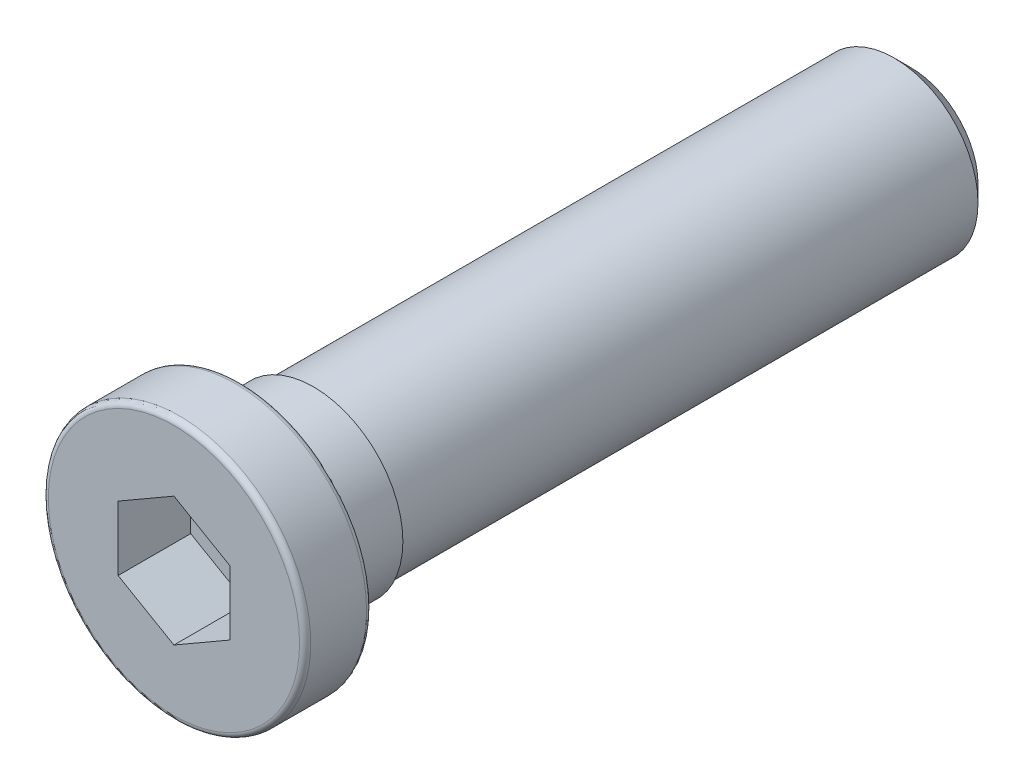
ISO-10303-21;
HEADER;
FILE_DESCRIPTION(('STEP AP214'),'2;1');
FILE_NAME('part.step','',(''),(''),'','','');
FILE_SCHEMA(('AUTOMOTIVE_DESIGN { 1 0 10303 214 1 1 1 1 }'));
ENDSEC;
DATA;
#1=APPLICATION_CONTEXT('core data for automotive mechanical design processes');
#2=APPLICATION_PROTOCOL_DEFINITION('international standard','automotive_design',2000,#1);
#3=PRODUCT_CONTEXT('',#1,'mechanical');
#4=PRODUCT('Part','Part','',(#3));
#5=PRODUCT_RELATED_PRODUCT_CATEGORY('part','',(#4));
#6=PRODUCT_DEFINITION_FORMATION('','',#4);
#7=PRODUCT_DEFINITION_CONTEXT('part definition',#1,'design');
#8=PRODUCT_DEFINITION('design','',#6,#7);
#9=PRODUCT_DEFINITION_SHAPE('','',#8);
#10=(LENGTH_UNIT() NAMED_UNIT(*) SI_UNIT(.MILLI.,.METRE.));
#11=(NAMED_UNIT(*) PLANE_ANGLE_UNIT() SI_UNIT($,.RADIAN.));
#12=(NAMED_UNIT(*) SI_UNIT($,.STERADIAN.) SOLID_ANGLE_UNIT());
#13=UNCERTAINTY_MEASURE_WITH_UNIT(LENGTH_MEASURE(1.E-05),#10,'distance_accuracy_value','');
#14=(GEOMETRIC_REPRESENTATION_CONTEXT(3) GLOBAL_UNCERTAINTY_ASSIGNED_CONTEXT((#13)) GLOBAL_UNIT_ASSIGNED_CONTEXT((#10,
#11,#12)) REPRESENTATION_CONTEXT('',''));
#15=CARTESIAN_POINT('',(0.,0.,0.));
#16=DIRECTION('',(0.,0.,1.));
#17=DIRECTION('',(1.,0.,0.));
#18=AXIS2_PLACEMENT_3D('',#15,#16,#17);
#19=CARTESIAN_POINT('',(0.,0.,11.9));
#20=DIRECTION('',(0.,0.,1.));
#21=DIRECTION('',(1.,0.,0.));
#22=AXIS2_PLACEMENT_3D('',#19,#20,#21);
#23=PLANE('',#22);
#24=DIRECTION('',(0.866025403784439,0.5,0.));
#25=VECTOR('',#24,1.);
#26=CARTESIAN_POINT('',(0.,-1.15470053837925,11.9));
#27=LINE('',#26,#25);
#28=CARTESIAN_POINT('',(0.,-1.15470053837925,11.9));
#29=VERTEX_POINT('',#28);
#30=CARTESIAN_POINT('',(1.,-0.577350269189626,11.9));
#31=VERTEX_POINT('',#30);
#32=EDGE_CURVE('E81',#29,#31,#27,.T.);
#33=ORIENTED_EDGE('',*,*,#32,.T.);
#34=DIRECTION('',(0.,1.,0.));
#35=VECTOR('',#34,1.);
#36=CARTESIAN_POINT('',(1.,-0.577350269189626,11.9));
#37=LINE('',#36,#35);
#38=CARTESIAN_POINT('',(1.,0.577350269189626,11.9));
#39=VERTEX_POINT('',#38);
#40=EDGE_CURVE('E83',#31,#39,#37,.T.);
#41=ORIENTED_EDGE('',*,*,#40,.T.);
#42=DIRECTION('',(-0.866025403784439,0.5,0.));
#43=VECTOR('',#42,1.);
#44=CARTESIAN_POINT('',(1.,0.577350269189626,11.9));
#45=LINE('',#44,#43);
#46=CARTESIAN_POINT('',(0.,1.15470053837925,11.9));
#47=VERTEX_POINT('',#46);
#48=EDGE_CURVE('E85',#39,#47,#45,.T.);
#49=ORIENTED_EDGE('',*,*,#48,.T.);
#50=DIRECTION('',(-0.866025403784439,-0.5,0.));
#51=VECTOR('',#50,1.);
#52=CARTESIAN_POINT('',(0.,1.15470053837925,11.9));
#53=LINE('',#52,#51);
#54=CARTESIAN_POINT('',(-1.,0.577350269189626,11.9));
#55=VERTEX_POINT('',#54);
#56=EDGE_CURVE('E188',#47,#55,#53,.T.);
#57=ORIENTED_EDGE('',*,*,#56,.T.);
#58=DIRECTION('',(0.,-1.,0.));
#59=VECTOR('',#58,1.);
#60=CARTESIAN_POINT('',(-1.,0.577350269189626,11.9));
#61=LINE('',#60,#59);
#62=CARTESIAN_POINT('',(-1.,-0.577350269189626,11.9));
#63=VERTEX_POINT('',#62);
#64=EDGE_CURVE('E193',#55,#63,#61,.T.);
#65=ORIENTED_EDGE('',*,*,#64,.T.);
#66=DIRECTION('',(0.866025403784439,-0.5,0.));
#67=VECTOR('',#66,1.);
#68=CARTESIAN_POINT('',(-1.,-0.577350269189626,11.9));
#69=LINE('',#68,#67);
#70=EDGE_CURVE('E197',#63,#29,#69,.T.);
#71=ORIENTED_EDGE('',*,*,#70,.T.);
#72=EDGE_LOOP('',(#33,#41,#49,#57,#65,#71));
#73=FACE_BOUND('',#72,.T.);
#74=ADVANCED_FACE('F17',(#73),#23,.T.);
#75=CARTESIAN_POINT('',(1.,0.577350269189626,11.9));
#76=DIRECTION('',(0.5,0.866025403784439,0.));
#77=DIRECTION('',(-0.866025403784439,0.5,0.));
#78=AXIS2_PLACEMENT_3D('',#75,#76,#77);
#79=PLANE('',#78);
#80=DIRECTION('',(0.,0.,1.));
#81=VECTOR('',#80,1.);
#82=CARTESIAN_POINT('',(0.,1.15470053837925,11.9));
#83=LINE('',#82,#81);
#84=CARTESIAN_POINT('',(0.,1.15470053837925,13.2));
#85=VERTEX_POINT('',#84);
#86=EDGE_CURVE('E96',#85,#47,#83,.F.);
#87=ORIENTED_EDGE('',*,*,#86,.T.);
#88=ORIENTED_EDGE('',*,*,#48,.F.);
#89=DIRECTION('',(0.,0.,1.));
#90=VECTOR('',#89,1.);
#91=CARTESIAN_POINT('',(1.,0.577350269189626,11.9));
#92=LINE('',#91,#90);
#93=CARTESIAN_POINT('',(1.,0.577350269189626,13.2));
#94=VERTEX_POINT('',#93);
#95=EDGE_CURVE('E90',#39,#94,#92,.T.);
#96=ORIENTED_EDGE('',*,*,#95,.T.);
#97=DIRECTION('',(0.866025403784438,-0.5,0.));
#98=VECTOR('',#97,1.);
#99=CARTESIAN_POINT('',(0.,1.15470053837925,13.2));
#100=LINE('',#99,#98);
#101=EDGE_CURVE('E187',#85,#94,#100,.T.);
#102=ORIENTED_EDGE('',*,*,#101,.F.);
#103=EDGE_LOOP('',(#87,#88,#96,#102));
#104=FACE_BOUND('',#103,.T.);
#105=ADVANCED_FACE('F93',(#104),#79,.F.);
#106=CARTESIAN_POINT('',(1.,-0.577350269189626,11.9));
#107=DIRECTION('',(1.,0.,0.));
#108=DIRECTION('',(0.,1.,0.));
#109=AXIS2_PLACEMENT_3D('',#106,#107,#108);
#110=PLANE('',#109);
#111=ORIENTED_EDGE('',*,*,#95,.F.);
#112=ORIENTED_EDGE('',*,*,#40,.F.);
#113=DIRECTION('',(0.,0.,1.));
#114=VECTOR('',#113,1.);
#115=CARTESIAN_POINT('',(1.,-0.577350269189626,11.9));
#116=LINE('',#115,#114);
#117=CARTESIAN_POINT('',(1.,-0.577350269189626,13.2));
#118=VERTEX_POINT('',#117);
#119=EDGE_CURVE('E104',#31,#118,#116,.T.);
#120=ORIENTED_EDGE('',*,*,#119,.T.);
#121=DIRECTION('',(0.,1.,0.));
#122=VECTOR('',#121,1.);
#123=CARTESIAN_POINT('',(1.,0.,13.2));
#124=LINE('',#123,#122);
#125=EDGE_CURVE('E101',#94,#118,#124,.F.);
#126=ORIENTED_EDGE('',*,*,#125,.F.);
#127=EDGE_LOOP('',(#111,#112,#120,#126));
#128=FACE_BOUND('',#127,.T.);
#129=ADVANCED_FACE('F99',(#128),#110,.F.);
#130=CARTESIAN_POINT('',(0.,-1.15470053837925,11.9));
#131=DIRECTION('',(0.5,-0.866025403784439,0.));
#132=DIRECTION('',(0.866025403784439,0.5,0.));
#133=AXIS2_PLACEMENT_3D('',#130,#131,#132);
#134=PLANE('',#133);
#135=ORIENTED_EDGE('',*,*,#119,.F.);
#136=ORIENTED_EDGE('',*,*,#32,.F.);
#137=DIRECTION('',(0.,0.,1.));
#138=VECTOR('',#137,1.);
#139=CARTESIAN_POINT('',(0.,-1.15470053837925,11.9));
#140=LINE('',#139,#138);
#141=CARTESIAN_POINT('',(0.,-1.15470053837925,13.2));
#142=VERTEX_POINT('',#141);
#143=EDGE_CURVE('E195',#29,#142,#140,.T.);
#144=ORIENTED_EDGE('',*,*,#143,.T.);
#145=DIRECTION('',(-0.866025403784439,-0.5,0.));
#146=VECTOR('',#145,1.);
#147=CARTESIAN_POINT('',(1.,-0.577350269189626,13.2));
#148=LINE('',#147,#146);
#149=EDGE_CURVE('E201',#118,#142,#148,.T.);
#150=ORIENTED_EDGE('',*,*,#149,.F.);
#151=EDGE_LOOP('',(#135,#136,#144,#150));
#152=FACE_BOUND('',#151,.T.);
#153=ADVANCED_FACE('F202',(#152),#134,.F.);
#154=CARTESIAN_POINT('',(-1.,-0.577350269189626,11.9));
#155=DIRECTION('',(-0.5,-0.866025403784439,0.));
#156=DIRECTION('',(0.866025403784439,-0.5,0.));
#157=AXIS2_PLACEMENT_3D('',#154,#155,#156);
#158=PLANE('',#157);
#159=ORIENTED_EDGE('',*,*,#143,.F.);
#160=ORIENTED_EDGE('',*,*,#70,.F.);
#161=DIRECTION('',(0.,0.,1.));
#162=VECTOR('',#161,1.);
#163=CARTESIAN_POINT('',(-1.,-0.577350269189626,11.9));
#164=LINE('',#163,#162);
#165=CARTESIAN_POINT('',(-1.,-0.577350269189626,13.2));
#166=VERTEX_POINT('',#165);
#167=EDGE_CURVE('E191',#63,#166,#164,.T.);
#168=ORIENTED_EDGE('',*,*,#167,.T.);
#169=DIRECTION('',(-0.866025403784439,0.5,0.));
#170=VECTOR('',#169,1.);
#171=CARTESIAN_POINT('',(0.,-1.15470053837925,13.2));
#172=LINE('',#171,#170);
#173=EDGE_CURVE('E207',#142,#166,#172,.T.);
#174=ORIENTED_EDGE('',*,*,#173,.F.);
#175=EDGE_LOOP('',(#159,#160,#168,#174));
#176=FACE_BOUND('',#175,.T.);
#177=ADVANCED_FACE('F325',(#176),#158,.F.);
#178=CARTESIAN_POINT('',(-1.,0.577350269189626,11.9));
#179=DIRECTION('',(-1.,0.,0.));
#180=DIRECTION('',(0.,-1.,0.));
#181=AXIS2_PLACEMENT_3D('',#178,#179,#180);
#182=PLANE('',#181);
#183=ORIENTED_EDGE('',*,*,#167,.F.);
#184=ORIENTED_EDGE('',*,*,#64,.F.);
#185=DIRECTION('',(0.,0.,1.));
#186=VECTOR('',#185,1.);
#187=CARTESIAN_POINT('',(-1.,0.577350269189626,11.9));
#188=LINE('',#187,#186);
#189=CARTESIAN_POINT('',(-1.,0.577350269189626,13.2));
#190=VERTEX_POINT('',#189);
#191=EDGE_CURVE('E180',#55,#190,#188,.T.);
#192=ORIENTED_EDGE('',*,*,#191,.T.);
#193=DIRECTION('',(0.,1.,0.));
#194=VECTOR('',#193,1.);
#195=CARTESIAN_POINT('',(-1.,0.,13.2));
#196=LINE('',#195,#194);
#197=EDGE_CURVE('E215',#166,#190,#196,.T.);
#198=ORIENTED_EDGE('',*,*,#197,.F.);
#199=EDGE_LOOP('',(#183,#184,#192,#198));
#200=FACE_BOUND('',#199,.T.);
#201=ADVANCED_FACE('F243',(#200),#182,.F.);
#202=CARTESIAN_POINT('',(0.,1.15470053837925,11.9));
#203=DIRECTION('',(-0.5,0.866025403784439,0.));
#204=DIRECTION('',(-0.866025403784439,-0.5,0.));
#205=AXIS2_PLACEMENT_3D('',#202,#203,#204);
#206=PLANE('',#205);
#207=ORIENTED_EDGE('',*,*,#191,.F.);
#208=ORIENTED_EDGE('',*,*,#56,.F.);
#209=ORIENTED_EDGE('',*,*,#86,.F.);
#210=DIRECTION('',(0.866025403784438,0.5,0.));
#211=VECTOR('',#210,1.);
#212=CARTESIAN_POINT('',(-1.,0.577350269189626,13.2));
#213=LINE('',#212,#211);
#214=EDGE_CURVE('E217',#190,#85,#213,.T.);
#215=ORIENTED_EDGE('',*,*,#214,.F.);
#216=EDGE_LOOP('',(#207,#208,#209,#215));
#217=FACE_BOUND('',#216,.T.);
#218=ADVANCED_FACE('F238',(#217),#206,.F.);
#219=CARTESIAN_POINT('',(0.,0.,13.2));
#220=DIRECTION('',(0.,0.,1.));
#221=DIRECTION('',(1.,0.,0.));
#222=AXIS2_PLACEMENT_3D('',#219,#220,#221);
#223=PLANE('',#222);
#224=ORIENTED_EDGE('',*,*,#197,.T.);
#225=ORIENTED_EDGE('',*,*,#214,.T.);
#226=ORIENTED_EDGE('',*,*,#101,.T.);
#227=ORIENTED_EDGE('',*,*,#125,.T.);
#228=ORIENTED_EDGE('',*,*,#149,.T.);
#229=ORIENTED_EDGE('',*,*,#173,.T.);
#230=EDGE_LOOP('',(#224,#225,#226,#227,#228,#229));
#231=FACE_BOUND('',#230,.T.);
#232=CARTESIAN_POINT('',(0.,0.,13.2));
#233=DIRECTION('',(0.,0.,-1.));
#234=DIRECTION('',(-1.,0.,0.));
#235=AXIS2_PLACEMENT_3D('',#232,#233,#234);
#236=CIRCLE('',#235,2.25);
#237=CARTESIAN_POINT('',(-2.25,0.,13.2));
#238=VERTEX_POINT('',#237);
#239=CARTESIAN_POINT('',(2.25,0.,13.2));
#240=VERTEX_POINT('',#239);
#241=EDGE_CURVE('E219',#238,#240,#236,.T.);
#242=ORIENTED_EDGE('',*,*,#241,.F.);
#243=CARTESIAN_POINT('',(0.,0.,13.2));
#244=DIRECTION('',(0.,0.,-1.));
#245=DIRECTION('',(1.,0.,0.));
#246=AXIS2_PLACEMENT_3D('',#243,#244,#245);
#247=CIRCLE('',#246,2.25);
#248=EDGE_CURVE('E160',#240,#238,#247,.T.);
#249=ORIENTED_EDGE('',*,*,#248,.F.);
#250=EDGE_LOOP('',(#242,#249));
#251=FACE_BOUND('',#250,.T.);
#252=ADVANCED_FACE('F168',(#231,#251),#223,.T.);
#253=CARTESIAN_POINT('',(0.,0.,13.1));
#254=DIRECTION('',(0.,0.,1.));
#255=DIRECTION('',(1.,0.,0.));
#256=AXIS2_PLACEMENT_3D('',#253,#254,#255);
#257=TOROIDAL_SURFACE('',#256,2.25,0.1);
#258=CARTESIAN_POINT('',(0.,0.,13.1));
#259=DIRECTION('',(0.,0.,-1.));
#260=DIRECTION('',(-1.,0.,0.));
#261=AXIS2_PLACEMENT_3D('',#258,#259,#260);
#262=CIRCLE('',#261,2.35);
#263=CARTESIAN_POINT('',(-2.35,0.,13.1));
#264=VERTEX_POINT('',#263);
#265=EDGE_CURVE('E157',#264,#264,#262,.T.);
#266=ORIENTED_EDGE('',*,*,#265,.F.);
#267=EDGE_LOOP('',(#266));
#268=FACE_BOUND('',#267,.T.);
#269=ORIENTED_EDGE('',*,*,#248,.T.);
#270=ORIENTED_EDGE('',*,*,#241,.T.);
#271=EDGE_LOOP('',(#269,#270));
#272=FACE_BOUND('',#271,.T.);
#273=ADVANCED_FACE('F164',(#268,#272),#257,.T.);
#274=CARTESIAN_POINT('',(0.,0.,13.2));
#275=DIRECTION('',(0.,0.,-1.));
#276=DIRECTION('',(-1.,0.,0.));
#277=AXIS2_PLACEMENT_3D('',#274,#275,#276);
#278=CYLINDRICAL_SURFACE('',#277,2.35);
#279=ORIENTED_EDGE('',*,*,#265,.T.);
#280=EDGE_LOOP('',(#279));
#281=FACE_BOUND('',#280,.T.);
#282=CARTESIAN_POINT('',(0.,0.,12.1));
#283=DIRECTION('',(0.,0.,1.));
#284=DIRECTION('',(1.,0.,0.));
#285=AXIS2_PLACEMENT_3D('',#282,#283,#284);
#286=CIRCLE('',#285,2.35);
#287=CARTESIAN_POINT('',(2.35,0.,12.1));
#288=VERTEX_POINT('',#287);
#289=EDGE_CURVE('E149',#288,#288,#286,.F.);
#290=ORIENTED_EDGE('',*,*,#289,.F.);
#291=EDGE_LOOP('',(#290));
#292=FACE_BOUND('',#291,.T.);
#293=ADVANCED_FACE('F135',(#281,#292),#278,.T.);
#294=CARTESIAN_POINT('',(0.,0.,12.1));
#295=DIRECTION('',(0.,0.,1.));
#296=DIRECTION('',(1.,0.,0.));
#297=AXIS2_PLACEMENT_3D('',#294,#295,#296);
#298=TOROIDAL_SURFACE('',#297,2.25,0.1);
#299=CARTESIAN_POINT('',(0.,0.,12.));
#300=DIRECTION('',(0.,0.,1.));
#301=DIRECTION('',(1.,0.,0.));
#302=AXIS2_PLACEMENT_3D('',#299,#300,#301);
#303=CIRCLE('',#302,2.25);
#304=CARTESIAN_POINT('',(2.25,0.,12.));
#305=VERTEX_POINT('',#304);
#306=CARTESIAN_POINT('',(-2.25,0.,12.));
#307=VERTEX_POINT('',#306);
#308=EDGE_CURVE('E36',#305,#307,#303,.T.);
#309=ORIENTED_EDGE('',*,*,#308,.T.);
#310=CARTESIAN_POINT('',(0.,0.,12.));
#311=DIRECTION('',(0.,0.,1.));
#312=DIRECTION('',(-1.,0.,0.));
#313=AXIS2_PLACEMENT_3D('',#310,#311,#312);
#314=CIRCLE('',#313,2.25);
#315=EDGE_CURVE('E118',#307,#305,#314,.T.);
#316=ORIENTED_EDGE('',*,*,#315,.T.);
#317=EDGE_LOOP('',(#309,#316));
#318=FACE_BOUND('',#317,.T.);
#319=ORIENTED_EDGE('',*,*,#289,.T.);
#320=EDGE_LOOP('',(#319));
#321=FACE_BOUND('',#320,.T.);
#322=ADVANCED_FACE('F123',(#318,#321),#298,.T.);
#323=CARTESIAN_POINT('',(0.,0.,12.));
#324=DIRECTION('',(0.,0.,1.));
#325=DIRECTION('',(1.,0.,0.));
#326=AXIS2_PLACEMENT_3D('',#323,#324,#325);
#327=PLANE('',#326);
#328=CARTESIAN_POINT('',(0.,0.,12.));
#329=DIRECTION('',(0.,0.,-1.));
#330=DIRECTION('',(-1.,0.,0.));
#331=AXIS2_PLACEMENT_3D('',#328,#329,#330);
#332=CIRCLE('',#331,1.6);
#333=CARTESIAN_POINT('',(-1.6,0.,12.));
#334=VERTEX_POINT('',#333);
#335=EDGE_CURVE('E116',#334,#334,#332,.T.);
#336=ORIENTED_EDGE('',*,*,#335,.F.);
#337=EDGE_LOOP('',(#336));
#338=FACE_BOUND('',#337,.T.);
#339=ORIENTED_EDGE('',*,*,#308,.F.);
#340=ORIENTED_EDGE('',*,*,#315,.F.);
#341=EDGE_LOOP('',(#339,#340));
#342=FACE_BOUND('',#341,.T.);
#343=ADVANCED_FACE('F134',(#338,#342),#327,.F.);
#344=CARTESIAN_POINT('',(0.,0.,12.));
#345=DIRECTION('',(0.,0.,-1.));
#346=DIRECTION('',(-1.,0.,0.));
#347=AXIS2_PLACEMENT_3D('',#344,#345,#346);
#348=CYLINDRICAL_SURFACE('',#347,1.6);
#349=ORIENTED_EDGE('',*,*,#335,.T.);
#350=EDGE_LOOP('',(#349));
#351=FACE_BOUND('',#350,.T.);
#352=CARTESIAN_POINT('',(0.,0.,10.7));
#353=DIRECTION('',(0.,0.,-1.));
#354=DIRECTION('',(-1.,0.,0.));
#355=AXIS2_PLACEMENT_3D('',#352,#353,#354);
#356=CIRCLE('',#355,1.6);
#357=CARTESIAN_POINT('',(-1.6,0.,10.7));
#358=VERTEX_POINT('',#357);
#359=EDGE_CURVE('E113',#358,#358,#356,.F.);
#360=ORIENTED_EDGE('',*,*,#359,.T.);
#361=EDGE_LOOP('',(#360));
#362=FACE_BOUND('',#361,.T.);
#363=ADVANCED_FACE('F263',(#351,#362),#348,.T.);
#364=CARTESIAN_POINT('',(0.,0.,0.));
#365=DIRECTION('',(0.,0.,1.));
#366=DIRECTION('',(1.,0.,0.));
#367=AXIS2_PLACEMENT_3D('',#364,#365,#366);
#368=PLANE('',#367);
#369=CARTESIAN_POINT('',(0.,0.,0.));
#370=DIRECTION('',(0.,0.,1.));
#371=DIRECTION('',(1.,0.,0.));
#372=AXIS2_PLACEMENT_3D('',#369,#370,#371);
#373=CIRCLE('',#372,1.19999999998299);
#374=CARTESIAN_POINT('',(1.19999999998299,0.,0.));
#375=VERTEX_POINT('',#374);
#376=EDGE_CURVE('E110',#375,#375,#373,.T.);
#377=ORIENTED_EDGE('',*,*,#376,.F.);
#378=EDGE_LOOP('',(#377));
#379=FACE_BOUND('',#378,.T.);
#380=ADVANCED_FACE('F260',(#379),#368,.F.);
#381=CARTESIAN_POINT('',(0.,0.,10.7));
#382=DIRECTION('',(0.,0.,1.));
#383=DIRECTION('',(1.,0.,0.));
#384=AXIS2_PLACEMENT_3D('',#381,#382,#383);
#385=PLANE('',#384);
#386=CARTESIAN_POINT('',(0.,0.,10.7));
#387=DIRECTION('',(0.,0.,-1.));
#388=DIRECTION('',(-1.,0.,0.));
#389=AXIS2_PLACEMENT_3D('',#386,#387,#388);
#390=CIRCLE('',#389,1.5);
#391=CARTESIAN_POINT('',(-1.5,0.,10.7));
#392=VERTEX_POINT('',#391);
#393=EDGE_CURVE('E28',#392,#392,#390,.T.);
#394=ORIENTED_EDGE('',*,*,#393,.F.);
#395=EDGE_LOOP('',(#394));
#396=FACE_BOUND('',#395,.T.);
#397=ORIENTED_EDGE('',*,*,#359,.F.);
#398=EDGE_LOOP('',(#397));
#399=FACE_BOUND('',#398,.T.);
#400=ADVANCED_FACE('F253',(#396,#399),#385,.F.);
#401=CARTESIAN_POINT('',(0.,0.,0.300000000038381));
#402=DIRECTION('',(0.,0.,1.));
#403=DIRECTION('',(1.,0.,0.));
#404=AXIS2_PLACEMENT_3D('',#401,#402,#403);
#405=CONICAL_SURFACE('',#404,1.50000000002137,0.785398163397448);
#406=CARTESIAN_POINT('',(0.,0.,0.300000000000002));
#407=DIRECTION('',(0.,0.,-1.));
#408=DIRECTION('',(-1.,0.,0.));
#409=AXIS2_PLACEMENT_3D('',#406,#407,#408);
#410=CIRCLE('',#409,1.5);
#411=CARTESIAN_POINT('',(-1.5,0.,0.300000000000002));
#412=VERTEX_POINT('',#411);
#413=EDGE_CURVE('E11',#412,#412,#410,.F.);
#414=ORIENTED_EDGE('',*,*,#413,.F.);
#415=EDGE_LOOP('',(#414));
#416=FACE_BOUND('',#415,.T.);
#417=ORIENTED_EDGE('',*,*,#376,.T.);
#418=EDGE_LOOP('',(#417));
#419=FACE_BOUND('',#418,.T.);
#420=ADVANCED_FACE('F247',(#416,#419),#405,.T.);
#421=CARTESIAN_POINT('',(0.,0.,10.7));
#422=DIRECTION('',(0.,0.,-1.));
#423=DIRECTION('',(-1.,0.,0.));
#424=AXIS2_PLACEMENT_3D('',#421,#422,#423);
#425=CYLINDRICAL_SURFACE('',#424,1.5);
#426=ORIENTED_EDGE('',*,*,#413,.T.);
#427=EDGE_LOOP('',(#426));
#428=FACE_BOUND('',#427,.T.);
#429=ORIENTED_EDGE('',*,*,#393,.T.);
#430=EDGE_LOOP('',(#429));
#431=FACE_BOUND('',#430,.T.);
#432=ADVANCED_FACE('F245',(#428,#431),#425,.T.);
#433=CLOSED_SHELL('',(#74,#105,#129,#153,#177,#201,#218,#252,#273,#293,#322,#343,#363,#380,#400,
#420,#432));
#434=MANIFOLD_SOLID_BREP('B1',#433);
#435=ADVANCED_BREP_SHAPE_REPRESENTATION('',(#18,#434),#14);
#436=SHAPE_DEFINITION_REPRESENTATION(#9,#435);
ENDSEC;
END-ISO-10303-21;
